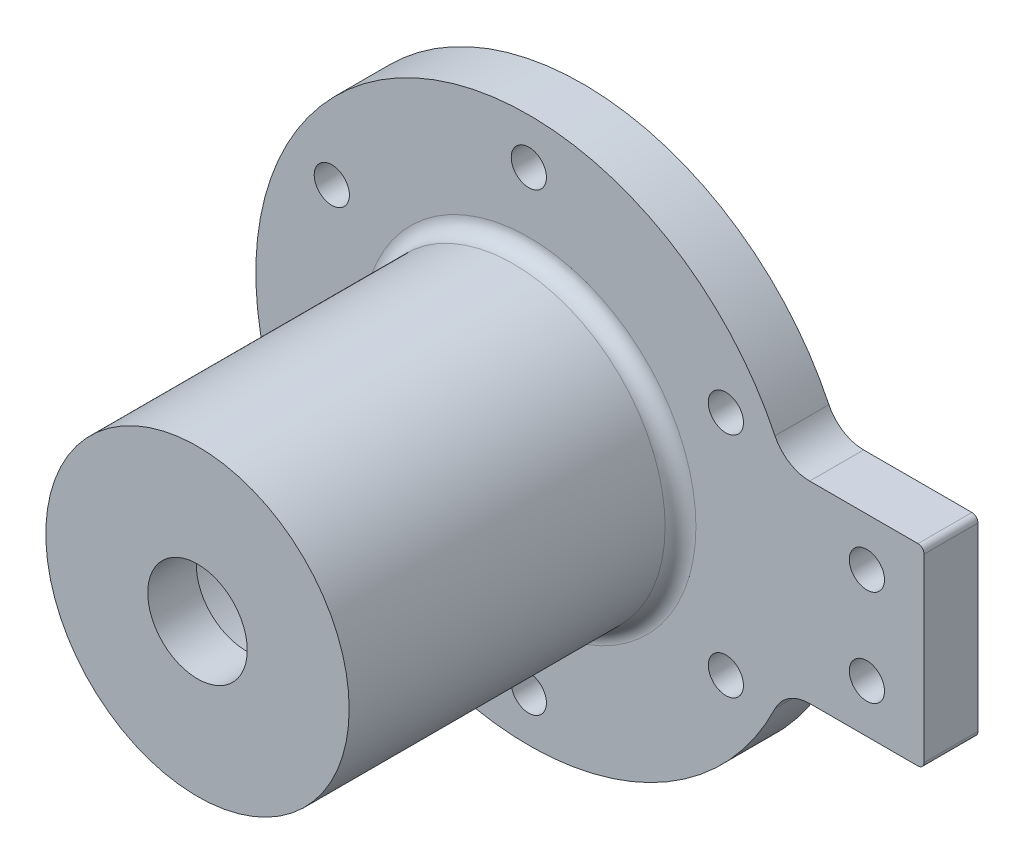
from build123d import *

# Parameters (mm, degrees)
SKETCH1_R            = 25
SKETCH1_R_2          = 20
BOSS_EXTRUDE1_DEPTH  = 63.5
BOSS_EXTRUDE2_START  = -8
SKETCH2_R            = 20
SKETCH2_R_2          = 6.15
BOSS_EXTRUDE2_DEPTH  = 8
SKETCH3_R            = 45
SKETCH3_R_2          = 25
BOSS_EXTRUDE3_DEPTH  = 8.89
SKETCH4_R            = 2.75
CUT_EXTRUDE1_DEPTH   = 90.901334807
BOSS_EXTRUDE4_START  = -8
SKETCH5_R            = 6.15
BOSS_EXTRUDE4_DEPTH  = 8
CUT_EXTRUDE2_REACH   = 86.441
BOSS_EXTRUDE5_DEPTH  = 8.89
FILLET1_R            = 6.35
BOSS_EXTRUDE6_DEPTH  = 8.89
M5_CLEARANCE_HOLE1_D = 5.8
M5_CLEARANCE_HOLE2_D = 5.8
BOSS_EXTRUDE7_START  = -8
SKETCH26_R           = 7.613
BOSS_EXTRUDE7_DEPTH  = 8
FILLET2_R            = 2.54
SKETCH27_R           = 8.2
CUT_EXTRUDE3_DEPTH   = 8
BOSS_EXTRUDE8_DEPTH  = 8.89


with BuildPart() as part:
    # Sketch1 → Boss-Extrude1 (new body)
    with BuildSketch(Plane.XY):
        Circle(SKETCH1_R)
        Circle(SKETCH1_R_2, mode=Mode.SUBTRACT)
    extrude(amount=BOSS_EXTRUDE1_DEPTH)

    # Sketch2 → Boss-Extrude2 (add)
    with BuildSketch(Plane.XY.offset(63.5).offset(BOSS_EXTRUDE2_START)):
        Circle(SKETCH2_R)
        Circle(SKETCH2_R_2, mode=Mode.SUBTRACT)
    extrude(amount=BOSS_EXTRUDE2_DEPTH)

    # Sketch3 → Boss-Extrude3 (add)
    with BuildSketch(Plane.XY):
        Circle(SKETCH3_R)
        Circle(SKETCH3_R_2, mode=Mode.SUBTRACT)
    extrude(amount=BOSS_EXTRUDE3_DEPTH)

    # Sketch4 → Cut-Extrude1 (cut, through all)
    with BuildSketch(Plane(origin=(0, 0, 0), x_dir=(-1, 0, 0), z_dir=(0, 0, -1))):
        with Locations((0, 37.5)):
            Circle(SKETCH4_R)
        with Locations((32.475952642, 18.75)):
            Circle(SKETCH4_R)
        with Locations((32.475952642, -18.75)):
            Circle(SKETCH4_R)
        with Locations((0, -37.5)):
            Circle(SKETCH4_R)
        with Locations((-32.475952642, -18.75)):
            Circle(SKETCH4_R)
        with Locations((-32.475952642, 18.75)):
            Circle(SKETCH4_R)
    extrude(amount=-CUT_EXTRUDE1_DEPTH, mode=Mode.SUBTRACT)

    # Sketch5 → Boss-Extrude4 (add)
    with BuildSketch(Plane.XY.offset(63.5).offset(BOSS_EXTRUDE4_START)):
        Circle(SKETCH5_R)
    extrude(amount=BOSS_EXTRUDE4_DEPTH)

    # Sketch7 → Cut-Extrude2 (cut, up to next)
    with BuildSketch(Plane(origin=(0, 0, 55.5), x_dir=(-1, 0, 0), z_dir=(0, 0, -1)), mode=Mode.PRIVATE) as cut_extrude2_sk1:
        with BuildLine():
            ThreePointArc((-0.374154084, -7.603800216), (3.8065, 6.593051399), (-6.39800711, -4.125927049))
            ThreePointArc((-6.39800711, -4.125927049), (-3.8065, -6.593051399), (-0.374154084, -7.603800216))
        make_face()
    cut_extrude2_tool1 = extrude(cut_extrude2_sk1.sketch, amount=-CUT_EXTRUDE2_REACH, mode=Mode.PRIVATE) & part.part
    add(cut_extrude2_tool1.solids().sort_by_distance((0, 0, 55.5))[0], mode=Mode.SUBTRACT)

    # Sketch9 → Boss-Extrude5 (add)
    with BuildSketch(Plane(origin=(0, 0, 0), x_dir=(-1, 0, 0), z_dir=(0, 0, -1))):
        with BuildLine():
            ThreePointArc((-42.106821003, -15.875), (-44.270797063, -8.068241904), (-45, 0))
            Line((-45, 0), (-61.51, 0))
            Line((-61.51, 0), (-61.51, -15.875))
            Line((-61.51, -15.875), (-42.106821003, -15.875))
        make_face()
        with BuildLine():
            Line((-61.51, 0), (-45, 0))
            ThreePointArc((-45, 0), (-44.270797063, 8.068241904), (-42.106821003, 15.875))
            Line((-42.106821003, 15.875), (-61.51, 15.875))
            Line((-61.51, 15.875), (-61.51, 0))
        make_face()
    extrude(amount=-BOSS_EXTRUDE5_DEPTH)

    # Fillet1
    fillet1_edges = [part.edges().sort_by_distance(p)[0] for p in [
        (42.106821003, 15.875, 4.445),
        (42.106821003, -15.875, 4.445),
        (61.51, -15.875, 4.445),
        (61.51, 15.875, 4.445),
    ]]
    fillet(fillet1_edges, radius=FILLET1_R)

    # Sketch17 → Boss-Extrude6 (add)
    with BuildSketch(Plane(origin=(0, 0, 8.89), x_dir=(-1, 0, 0), z_dir=(0, 0, -1))):
        with BuildLine():
            ThreePointArc((-61.51, 9.525), (-59.650128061, 14.015128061), (-55.16, 15.875))
            Line((-55.16, 15.875), (-62.600506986, 15.875))
            ThreePointArc((-62.600506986, 15.875), (-64.39655821, 15.131051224), (-65.140506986, 13.335))
            Line((-65.140506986, 13.335), (-65.140506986, 6.773333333))
            Line((-65.140506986, 6.773333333), (-65.140506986, -6.773333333))
            Line((-65.140506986, -6.773333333), (-65.140506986, -13.335))
            ThreePointArc((-65.140506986, -13.335), (-64.39655821, -15.131051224), (-62.600506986, -15.875))
            Line((-62.600506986, -15.875), (-55.16, -15.875))
            ThreePointArc((-55.16, -15.875), (-59.650128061, -14.015128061), (-61.51, -9.525))
            Line((-61.51, -9.525), (-61.51, 9.525))
        make_face()
    extrude(amount=BOSS_EXTRUDE6_DEPTH)

    # M5 Clearance Hole1 (through all)
    with Locations(Plane(origin=(0, 0, 0), x_dir=(-1, 0, 0), z_dir=(0, 0, -1))):
        with Locations((-55.71583555, 7.9375), (-55.71583555, -7.9375)):
            Hole(M5_CLEARANCE_HOLE1_D / 2)

    # M5 Clearance Hole2 (through all)
    with Locations(Plane(origin=(0, 0, 0), x_dir=(-1, 0, 0), z_dir=(0, 0, -1))):
        with Locations((-32.475952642, 18.75), (0, 37.5), (32.475952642, 18.75), (32.475952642, -18.75), (0, -37.5), (-32.475952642, -18.75)):
            Hole(M5_CLEARANCE_HOLE2_D / 2)

    # Sketch26 → Boss-Extrude7 (add)
    with BuildSketch(Plane.XY.offset(63.5).offset(BOSS_EXTRUDE7_START)):
        Circle(SKETCH26_R)
    extrude(amount=BOSS_EXTRUDE7_DEPTH)

    # Fillet2
    fillet2_edges = [part.edges().sort_by_distance(p)[0] for p in [
        (-25, 0, 8.89),
    ]]
    fillet(fillet2_edges, radius=FILLET2_R)

    # Sketch27 → Cut-Extrude3 (cut)
    with BuildSketch(Plane.XY.offset(63.5)):
        Circle(SKETCH27_R)
    extrude(amount=-CUT_EXTRUDE3_DEPTH, mode=Mode.SUBTRACT)

    # Sketch29 → Boss-Extrude8 (add)
    with BuildSketch(Plane(origin=(0, 0, 8.89), x_dir=(-1, 0, 0), z_dir=(0, 0, -1))):
        with BuildLine():
            ThreePointArc((-62.600506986, -15.875), (-64.39655821, -15.131051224), (-65.140506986, -13.335))
            Line((-65.140506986, -13.335), (-65.140506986, -14.875))
            ThreePointArc((-65.140506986, -14.875), (-64.847613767, -15.582106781), (-64.140506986, -15.875))
            Line((-64.140506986, -15.875), (-62.600506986, -15.875))
        make_face()
        with BuildLine():
            ThreePointArc((-65.140506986, 13.335), (-64.39655821, 15.131051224), (-62.600506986, 15.875))
            Line((-62.600506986, 15.875), (-64.140506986, 15.875))
            ThreePointArc((-64.140506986, 15.875), (-64.847613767, 15.582106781), (-65.140506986, 14.875))
            Line((-65.140506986, 14.875), (-65.140506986, 13.335))
        make_face()
    extrude(amount=BOSS_EXTRUDE8_DEPTH)


solid = part.part
